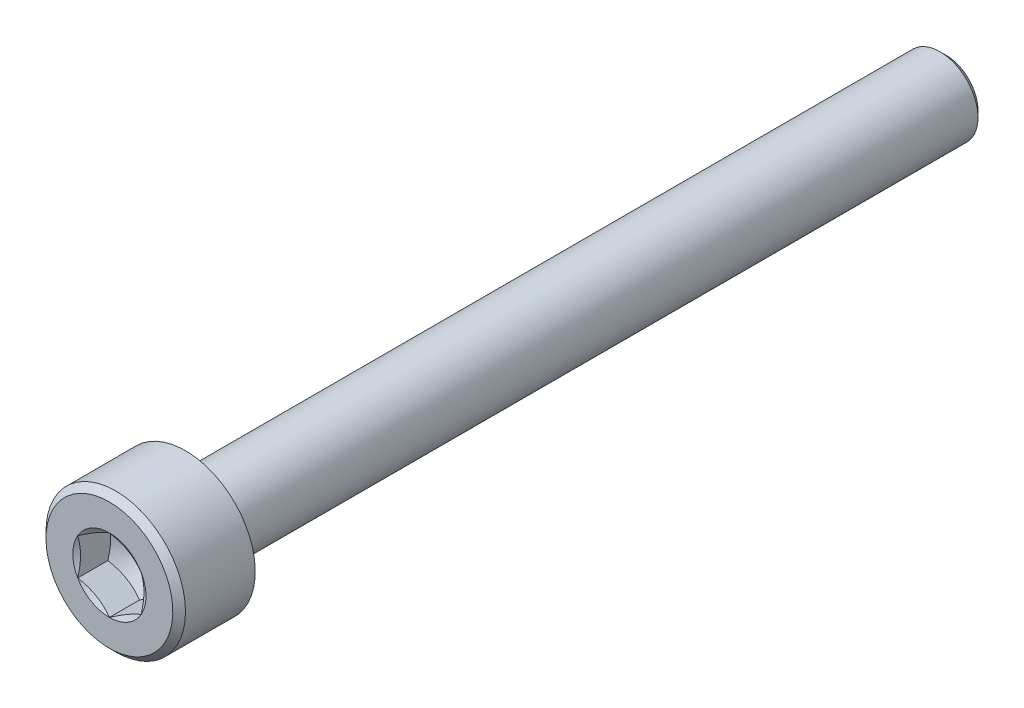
ISO-10303-21;
HEADER;
FILE_DESCRIPTION(('STEP AP214'),'2;1');
FILE_NAME('part.step','',(''),(''),'','','');
FILE_SCHEMA(('AUTOMOTIVE_DESIGN { 1 0 10303 214 1 1 1 1 }'));
ENDSEC;
DATA;
#1=APPLICATION_CONTEXT('core data for automotive mechanical design processes');
#2=APPLICATION_PROTOCOL_DEFINITION('international standard','automotive_design',2000,#1);
#3=PRODUCT_CONTEXT('',#1,'mechanical');
#4=PRODUCT('Part','Part','',(#3));
#5=PRODUCT_RELATED_PRODUCT_CATEGORY('part','',(#4));
#6=PRODUCT_DEFINITION_FORMATION('','',#4);
#7=PRODUCT_DEFINITION_CONTEXT('part definition',#1,'design');
#8=PRODUCT_DEFINITION('design','',#6,#7);
#9=PRODUCT_DEFINITION_SHAPE('','',#8);
#10=(LENGTH_UNIT() NAMED_UNIT(*) SI_UNIT(.MILLI.,.METRE.));
#11=(NAMED_UNIT(*) PLANE_ANGLE_UNIT() SI_UNIT($,.RADIAN.));
#12=(NAMED_UNIT(*) SI_UNIT($,.STERADIAN.) SOLID_ANGLE_UNIT());
#13=UNCERTAINTY_MEASURE_WITH_UNIT(LENGTH_MEASURE(1.E-05),#10,'distance_accuracy_value','');
#14=(GEOMETRIC_REPRESENTATION_CONTEXT(3) GLOBAL_UNCERTAINTY_ASSIGNED_CONTEXT((#13)) GLOBAL_UNIT_ASSIGNED_CONTEXT((#10,
#11,#12)) REPRESENTATION_CONTEXT('',''));
#15=CARTESIAN_POINT('',(0.,0.,0.));
#16=DIRECTION('',(0.,0.,1.));
#17=DIRECTION('',(1.,0.,0.));
#18=AXIS2_PLACEMENT_3D('',#15,#16,#17);
#19=CARTESIAN_POINT('',(0.,2.75,3.));
#20=DIRECTION('',(0.,0.,-1.));
#21=DIRECTION('',(0.,1.,0.));
#22=AXIS2_PLACEMENT_3D('',#19,#20,#21);
#23=PLANE('',#22);
#24=CARTESIAN_POINT('',(0.,0.,3.));
#25=DIRECTION('',(0.,0.,-1.));
#26=DIRECTION('',(0.,1.,0.));
#27=AXIS2_PLACEMENT_3D('',#24,#25,#26);
#28=CIRCLE('',#27,2.5);
#29=CARTESIAN_POINT('',(0.,2.5,3.));
#30=VERTEX_POINT('',#29);
#31=EDGE_CURVE('E298',#30,#30,#28,.F.);
#32=ORIENTED_EDGE('',*,*,#31,.T.);
#33=EDGE_LOOP('',(#32));
#34=FACE_BOUND('',#33,.T.);
#35=CARTESIAN_POINT('',(0.,0.,3.));
#36=DIRECTION('',(0.,0.,-1.));
#37=DIRECTION('',(0.,1.,0.));
#38=AXIS2_PLACEMENT_3D('',#35,#36,#37);
#39=CIRCLE('',#38,1.44337567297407);
#40=CARTESIAN_POINT('',(0.,1.44337567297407,3.));
#41=VERTEX_POINT('',#40);
#42=CARTESIAN_POINT('',(-1.25,0.721687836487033,3.));
#43=VERTEX_POINT('',#42);
#44=EDGE_CURVE('E109',#41,#43,#39,.F.);
#45=ORIENTED_EDGE('',*,*,#44,.F.);
#46=CARTESIAN_POINT('',(1.25,0.721687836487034,3.));
#47=VERTEX_POINT('',#46);
#48=EDGE_CURVE('E97',#47,#41,#39,.F.);
#49=ORIENTED_EDGE('',*,*,#48,.F.);
#50=CARTESIAN_POINT('',(1.25,-0.721687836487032,3.));
#51=VERTEX_POINT('',#50);
#52=EDGE_CURVE('E107',#51,#47,#39,.F.);
#53=ORIENTED_EDGE('',*,*,#52,.F.);
#54=CARTESIAN_POINT('',(0.,-1.44337567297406,3.));
#55=VERTEX_POINT('',#54);
#56=EDGE_CURVE('E474',#55,#51,#39,.F.);
#57=ORIENTED_EDGE('',*,*,#56,.F.);
#58=CARTESIAN_POINT('',(-1.25,-0.721687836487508,2.99999999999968));
#59=VERTEX_POINT('',#58);
#60=EDGE_CURVE('E142',#59,#55,#39,.F.);
#61=ORIENTED_EDGE('',*,*,#60,.F.);
#62=EDGE_CURVE('E139',#43,#59,#39,.F.);
#63=ORIENTED_EDGE('',*,*,#62,.F.);
#64=EDGE_LOOP('',(#45,#49,#53,#57,#61,#63));
#65=FACE_BOUND('',#64,.T.);
#66=ADVANCED_FACE('F40',(#34,#65),#23,.F.);
#67=CARTESIAN_POINT('',(0.,1.5,0.));
#68=DIRECTION('',(0.,0.,1.));
#69=DIRECTION('',(0.,-1.,0.));
#70=AXIS2_PLACEMENT_3D('',#67,#68,#69);
#71=PLANE('',#70);
#72=CARTESIAN_POINT('',(0.,0.,0.));
#73=DIRECTION('',(0.,0.,1.));
#74=DIRECTION('',(0.,-1.,0.));
#75=AXIS2_PLACEMENT_3D('',#72,#73,#74);
#76=CIRCLE('',#75,1.9);
#77=CARTESIAN_POINT('',(0.,-1.9,0.));
#78=VERTEX_POINT('',#77);
#79=EDGE_CURVE('E49',#78,#78,#76,.T.);
#80=ORIENTED_EDGE('',*,*,#79,.T.);
#81=EDGE_LOOP('',(#80));
#82=FACE_BOUND('',#81,.T.);
#83=CARTESIAN_POINT('',(0.,0.,0.));
#84=DIRECTION('',(0.,0.,1.));
#85=DIRECTION('',(0.,-1.,0.));
#86=AXIS2_PLACEMENT_3D('',#83,#84,#85);
#87=CIRCLE('',#86,2.75);
#88=CARTESIAN_POINT('',(0.,-2.75,0.));
#89=VERTEX_POINT('',#88);
#90=EDGE_CURVE('E442',#89,#89,#87,.T.);
#91=ORIENTED_EDGE('',*,*,#90,.F.);
#92=EDGE_LOOP('',(#91));
#93=FACE_BOUND('',#92,.T.);
#94=ADVANCED_FACE('F257',(#82,#93),#71,.F.);
#95=CARTESIAN_POINT('',(0.,0.,3.));
#96=DIRECTION('',(0.,0.,1.));
#97=DIRECTION('',(0.,-1.,0.));
#98=AXIS2_PLACEMENT_3D('',#95,#96,#97);
#99=CYLINDRICAL_SURFACE('',#98,1.5);
#100=CARTESIAN_POINT('',(0.,0.,-0.4));
#101=DIRECTION('',(0.,0.,1.));
#102=DIRECTION('',(0.,-1.,0.));
#103=AXIS2_PLACEMENT_3D('',#100,#101,#102);
#104=CIRCLE('',#103,1.5);
#105=CARTESIAN_POINT('',(0.,-1.5,-0.4));
#106=VERTEX_POINT('',#105);
#107=EDGE_CURVE('E12',#106,#106,#104,.F.);
#108=ORIENTED_EDGE('',*,*,#107,.T.);
#109=EDGE_LOOP('',(#108));
#110=FACE_BOUND('',#109,.T.);
#111=CARTESIAN_POINT('',(0.,0.,-29.75));
#112=DIRECTION('',(0.,0.,1.));
#113=DIRECTION('',(0.,-1.,0.));
#114=AXIS2_PLACEMENT_3D('',#111,#112,#113);
#115=CIRCLE('',#114,1.5);
#116=CARTESIAN_POINT('',(0.,-1.5,-29.75));
#117=VERTEX_POINT('',#116);
#118=EDGE_CURVE('E289',#117,#117,#115,.T.);
#119=ORIENTED_EDGE('',*,*,#118,.T.);
#120=EDGE_LOOP('',(#119));
#121=FACE_BOUND('',#120,.T.);
#122=ADVANCED_FACE('F262',(#110,#121),#99,.T.);
#123=CARTESIAN_POINT('',(0.,0.,-30.));
#124=DIRECTION('',(0.,0.,1.));
#125=DIRECTION('',(0.,-1.,0.));
#126=AXIS2_PLACEMENT_3D('',#123,#124,#125);
#127=PLANE('',#126);
#128=CARTESIAN_POINT('',(0.,0.,-30.));
#129=DIRECTION('',(0.,0.,1.));
#130=DIRECTION('',(0.,-1.,0.));
#131=AXIS2_PLACEMENT_3D('',#128,#129,#130);
#132=CIRCLE('',#131,1.25);
#133=CARTESIAN_POINT('',(0.,-1.25,-30.));
#134=VERTEX_POINT('',#133);
#135=EDGE_CURVE('E120',#134,#134,#132,.F.);
#136=ORIENTED_EDGE('',*,*,#135,.T.);
#137=EDGE_LOOP('',(#136));
#138=FACE_BOUND('',#137,.T.);
#139=ADVANCED_FACE('F267',(#138),#127,.F.);
#140=CARTESIAN_POINT('',(0.,0.,3.));
#141=DIRECTION('',(0.,0.,1.));
#142=DIRECTION('',(0.,-1.,0.));
#143=AXIS2_PLACEMENT_3D('',#140,#141,#142);
#144=CYLINDRICAL_SURFACE('',#143,2.75);
#145=CARTESIAN_POINT('',(0.,0.,2.75));
#146=DIRECTION('',(0.,0.,-1.));
#147=DIRECTION('',(0.,1.,0.));
#148=AXIS2_PLACEMENT_3D('',#145,#146,#147);
#149=CIRCLE('',#148,2.75);
#150=CARTESIAN_POINT('',(0.,2.75,2.75));
#151=VERTEX_POINT('',#150);
#152=EDGE_CURVE('E292',#151,#151,#149,.T.);
#153=ORIENTED_EDGE('',*,*,#152,.T.);
#154=EDGE_LOOP('',(#153));
#155=FACE_BOUND('',#154,.T.);
#156=ORIENTED_EDGE('',*,*,#90,.T.);
#157=EDGE_LOOP('',(#156));
#158=FACE_BOUND('',#157,.T.);
#159=ADVANCED_FACE('F177',(#155,#158),#144,.T.);
#160=CARTESIAN_POINT('',(0.,0.,3.));
#161=DIRECTION('',(0.,0.,-1.));
#162=DIRECTION('',(0.,1.,0.));
#163=AXIS2_PLACEMENT_3D('',#160,#161,#162);
#164=CONICAL_SURFACE('',#163,2.5,0.785398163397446);
#165=ORIENTED_EDGE('',*,*,#152,.F.);
#166=EDGE_LOOP('',(#165));
#167=FACE_BOUND('',#166,.T.);
#168=ORIENTED_EDGE('',*,*,#31,.F.);
#169=EDGE_LOOP('',(#168));
#170=FACE_BOUND('',#169,.T.);
#171=ADVANCED_FACE('F274',(#167,#170),#164,.T.);
#172=CARTESIAN_POINT('',(0.,0.,-29.75));
#173=DIRECTION('',(0.,0.,1.));
#174=DIRECTION('',(0.,-1.,0.));
#175=AXIS2_PLACEMENT_3D('',#172,#173,#174);
#176=CONICAL_SURFACE('',#175,1.5,0.785398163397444);
#177=ORIENTED_EDGE('',*,*,#135,.F.);
#178=EDGE_LOOP('',(#177));
#179=FACE_BOUND('',#178,.T.);
#180=ORIENTED_EDGE('',*,*,#118,.F.);
#181=EDGE_LOOP('',(#180));
#182=FACE_BOUND('',#181,.T.);
#183=ADVANCED_FACE('F276',(#179,#182),#176,.T.);
#184=CARTESIAN_POINT('',(0.,0.,2.8883545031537));
#185=DIRECTION('',(0.,0.,1.));
#186=DIRECTION('',(0.,-1.,0.));
#187=AXIS2_PLACEMENT_3D('',#184,#185,#186);
#188=CONICAL_SURFACE('',#187,1.25,1.04719755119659);
#189=ORIENTED_EDGE('',*,*,#44,.T.);
#190=CARTESIAN_POINT('',(-1.2502,0.721572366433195,3.00006667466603));
#191=CARTESIAN_POINT('',(-1.19526669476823,0.753288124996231,2.98174591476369));
#192=CARTESIAN_POINT('',(-1.13985921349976,0.785277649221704,2.96508330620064));
#193=CARTESIAN_POINT('',(-1.02808463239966,0.849810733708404,2.93599730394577));
#194=CARTESIAN_POINT('',(-0.971715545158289,0.882355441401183,2.92358420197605));
#195=CARTESIAN_POINT('',(-0.859676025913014,0.947041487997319,2.90425968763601));
#196=CARTESIAN_POINT('',(-0.804022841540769,0.979172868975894,2.89721968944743));
#197=CARTESIAN_POINT('',(-0.692454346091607,1.04358696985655,2.88881243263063));
#198=CARTESIAN_POINT('',(-0.636539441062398,1.07586945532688,2.88743821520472));
#199=CARTESIAN_POINT('',(-0.532042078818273,1.13620103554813,2.89028333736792));
#200=CARTESIAN_POINT('',(-0.483444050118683,1.16425912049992,2.89380409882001));
#201=CARTESIAN_POINT('',(-0.38656463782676,1.22019247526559,2.90496711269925));
#202=CARTESIAN_POINT('',(-0.338283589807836,1.24806755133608,2.91261318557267));
#203=CARTESIAN_POINT('',(-0.241204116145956,1.30411641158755,2.93172945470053));
#204=CARTESIAN_POINT('',(-0.1924179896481,1.33228309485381,2.94328075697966));
#205=CARTESIAN_POINT('',(-0.0955737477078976,1.38819614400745,2.96949831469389));
#206=CARTESIAN_POINT('',(-0.0475143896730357,1.41594322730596,2.9841584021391));
#207=CARTESIAN_POINT('',(0.000199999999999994,1.4434911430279,3.00006667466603));
#208=B_SPLINE_CURVE_WITH_KNOTS('',3,(#190,#191,#192,#193,#194,#195,#196,#197,#198,#199,#200,
#201,#202,#203,#204,#205,#206,#207),.UNSPECIFIED.,.F.,.F.,(4,2,2,2,2,2,2,2,4),(0.,
0.19815082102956,0.396778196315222,0.590488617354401,0.783961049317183,0.952480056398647,
1.1211553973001,1.2935743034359,1.4656542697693),.UNSPECIFIED.);
#209=EDGE_CURVE('E113',#43,#41,#208,.T.);
#210=ORIENTED_EDGE('',*,*,#209,.T.);
#211=EDGE_LOOP('',(#189,#210));
#212=FACE_BOUND('',#211,.T.);
#213=ADVANCED_FACE('F114',(#212),#188,.F.);
#214=ORIENTED_EDGE('',*,*,#62,.T.);
#215=CARTESIAN_POINT('',(-1.25,-1.91402249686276,3.48651288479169));
#216=CARTESIAN_POINT('',(-1.25,-1.85914046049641,3.45999038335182));
#217=CARTESIAN_POINT('',(-1.25,-1.80412861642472,3.43373221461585));
#218=CARTESIAN_POINT('',(-1.25,-1.69377524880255,3.38189383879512));
#219=CARTESIAN_POINT('',(-1.25,-1.6384336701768,3.35631374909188));
#220=CARTESIAN_POINT('',(-1.25,-1.52705181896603,3.30584606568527));
#221=CARTESIAN_POINT('',(-1.25,-1.47100936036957,3.28096327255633));
#222=CARTESIAN_POINT('',(-1.25,-1.35846343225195,3.23227191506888));
#223=CARTESIAN_POINT('',(-1.25,-1.30195998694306,3.20846329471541));
#224=CARTESIAN_POINT('',(-1.25,-1.13023285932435,3.13847265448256));
#225=CARTESIAN_POINT('',(-1.25,-1.0141519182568,3.09435658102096));
#226=CARTESIAN_POINT('',(-1.25,-0.779052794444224,3.01526341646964));
#227=CARTESIAN_POINT('',(-1.25,-0.660042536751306,2.98026411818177));
#228=CARTESIAN_POINT('',(-1.25,-0.478932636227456,2.93885499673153));
#229=CARTESIAN_POINT('',(-1.25,-0.418117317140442,2.92689892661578));
#230=CARTESIAN_POINT('',(-1.25,-0.295751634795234,2.90750168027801));
#231=CARTESIAN_POINT('',(-1.25,-0.234201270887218,2.90006050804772));
#232=CARTESIAN_POINT('',(-1.25,-0.11107808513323,2.8903495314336));
#233=CARTESIAN_POINT('',(-1.25,-0.0495079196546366,2.88804698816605));
#234=CARTESIAN_POINT('',(-1.25,0.0735831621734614,2.88872894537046));
#235=CARTESIAN_POINT('',(-1.25,0.135104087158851,2.8917120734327));
#236=CARTESIAN_POINT('',(-1.25,0.283935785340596,2.90505722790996));
#237=CARTESIAN_POINT('',(-1.25,0.371012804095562,2.91803134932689));
#238=CARTESIAN_POINT('',(-1.25,0.543555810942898,2.95222917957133));
#239=CARTESIAN_POINT('',(-1.25,0.629019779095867,2.97346259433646));
#240=CARTESIAN_POINT('',(-1.25,0.756929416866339,3.01007884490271));
#241=CARTESIAN_POINT('',(-1.25,0.800029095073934,3.02326523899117));
#242=CARTESIAN_POINT('',(-1.25,0.885776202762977,3.05094330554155));
#243=CARTESIAN_POINT('',(-1.25,0.928423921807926,3.06543407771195));
#244=CARTESIAN_POINT('',(-1.25,1.01309180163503,3.09541882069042));
#245=CARTESIAN_POINT('',(-1.25,1.05511414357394,3.1109066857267));
#246=CARTESIAN_POINT('',(-1.25,1.13883279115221,3.14279147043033));
#247=CARTESIAN_POINT('',(-1.25,1.18052895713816,3.15918875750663));
#248=CARTESIAN_POINT('',(-1.25,1.22207405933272,3.17595106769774));
#249=B_SPLINE_CURVE_WITH_KNOTS('',3,(#215,#216,#217,#218,#219,#220,#221,#222,#223,#224,#225,
#226,#227,#228,#229,#230,#231,#232,#233,#234,#235,#236,#237,#238,#239,#240,#241,#242,#243,#244,
#245,#246,#247,#248),.UNSPECIFIED.,.F.,.F.,(4,2,2,2,2,2,2,2,2,2,2,2,2,2,2,2,4),(0.,
0.182866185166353,0.365763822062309,0.549708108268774,0.733642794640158,1.10600436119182,
1.47745024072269,1.66325057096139,1.84905106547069,2.03366437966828,2.21822976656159,
2.48180397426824,2.74568886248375,2.88088820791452,3.01599494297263,3.15034120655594,
3.28474214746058),.UNSPECIFIED.);
#250=EDGE_CURVE('E239',#59,#43,#249,.T.);
#251=ORIENTED_EDGE('',*,*,#250,.T.);
#252=EDGE_LOOP('',(#214,#251));
#253=FACE_BOUND('',#252,.T.);
#254=ADVANCED_FACE('F283',(#253),#188,.F.);
#255=ORIENTED_EDGE('',*,*,#60,.T.);
#256=CARTESIAN_POINT('',(0.000200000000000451,-1.4434911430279,3.00006667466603));
#257=CARTESIAN_POINT('',(-0.0547333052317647,-1.41177538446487,2.98174591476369));
#258=CARTESIAN_POINT('',(-0.110140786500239,-1.37978586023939,2.96508330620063));
#259=CARTESIAN_POINT('',(-0.22191536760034,-1.31525277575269,2.93599730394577));
#260=CARTESIAN_POINT('',(-0.27828445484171,-1.28270806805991,2.92358420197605));
#261=CARTESIAN_POINT('',(-0.390323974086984,-1.21802202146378,2.90425968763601));
#262=CARTESIAN_POINT('',(-0.445977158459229,-1.1858906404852,2.89721968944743));
#263=CARTESIAN_POINT('',(-0.557545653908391,-1.12147653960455,2.88881243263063));
#264=CARTESIAN_POINT('',(-0.6134605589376,-1.08919405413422,2.88743821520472));
#265=CARTESIAN_POINT('',(-0.717957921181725,-1.02886247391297,2.89028333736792));
#266=CARTESIAN_POINT('',(-0.766555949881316,-1.00080438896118,2.89380409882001));
#267=CARTESIAN_POINT('',(-0.863435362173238,-0.944871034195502,2.90496711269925));
#268=CARTESIAN_POINT('',(-0.911716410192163,-0.916995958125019,2.91261318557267));
#269=CARTESIAN_POINT('',(-1.00879588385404,-0.860947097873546,2.93172945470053));
#270=CARTESIAN_POINT('',(-1.0575820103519,-0.832780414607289,2.94328075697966));
#271=CARTESIAN_POINT('',(-1.1544262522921,-0.776867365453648,2.96949831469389));
#272=CARTESIAN_POINT('',(-1.20248561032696,-0.74912028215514,2.9841584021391));
#273=CARTESIAN_POINT('',(-1.2502,-0.721572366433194,3.00006667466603));
#274=B_SPLINE_CURVE_WITH_KNOTS('',3,(#256,#257,#258,#259,#260,#261,#262,#263,#264,#265,#266,
#267,#268,#269,#270,#271,#272,#273),.UNSPECIFIED.,.F.,.F.,(4,2,2,2,2,2,2,2,4),(0.,
0.19815082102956,0.396778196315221,0.5904886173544,0.783961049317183,0.952480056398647,
1.1211553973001,1.2935743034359,1.4656542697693),.UNSPECIFIED.);
#275=EDGE_CURVE('E232',#55,#59,#274,.T.);
#276=ORIENTED_EDGE('',*,*,#275,.T.);
#277=EDGE_LOOP('',(#255,#276));
#278=FACE_BOUND('',#277,.T.);
#279=ADVANCED_FACE('F385',(#278),#188,.F.);
#280=ORIENTED_EDGE('',*,*,#56,.T.);
#281=CARTESIAN_POINT('',(1.2502,-0.721572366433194,3.00006667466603));
#282=CARTESIAN_POINT('',(1.19526669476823,-0.75328812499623,2.98174591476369));
#283=CARTESIAN_POINT('',(1.13985921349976,-0.785277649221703,2.96508330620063));
#284=CARTESIAN_POINT('',(1.02808463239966,-0.849810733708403,2.93599730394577));
#285=CARTESIAN_POINT('',(0.971715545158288,-0.882355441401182,2.92358420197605));
#286=CARTESIAN_POINT('',(0.859676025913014,-0.947041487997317,2.90425968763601));
#287=CARTESIAN_POINT('',(0.804022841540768,-0.979172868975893,2.89721968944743));
#288=CARTESIAN_POINT('',(0.692454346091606,-1.04358696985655,2.88881243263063));
#289=CARTESIAN_POINT('',(0.636539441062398,-1.07586945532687,2.88743821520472));
#290=CARTESIAN_POINT('',(0.532042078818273,-1.13620103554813,2.89028333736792));
#291=CARTESIAN_POINT('',(0.483444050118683,-1.16425912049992,2.89380409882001));
#292=CARTESIAN_POINT('',(0.38656463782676,-1.22019247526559,2.90496711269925));
#293=CARTESIAN_POINT('',(0.338283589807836,-1.24806755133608,2.91261318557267));
#294=CARTESIAN_POINT('',(0.241204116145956,-1.30411641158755,2.93172945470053));
#295=CARTESIAN_POINT('',(0.1924179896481,-1.33228309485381,2.94328075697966));
#296=CARTESIAN_POINT('',(0.095573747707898,-1.38819614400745,2.96949831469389));
#297=CARTESIAN_POINT('',(0.0475143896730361,-1.41594322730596,2.9841584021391));
#298=CARTESIAN_POINT('',(-0.000199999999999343,-1.4434911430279,3.00006667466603));
#299=B_SPLINE_CURVE_WITH_KNOTS('',3,(#281,#282,#283,#284,#285,#286,#287,#288,#289,#290,#291,
#292,#293,#294,#295,#296,#297,#298),.UNSPECIFIED.,.F.,.F.,(4,2,2,2,2,2,2,2,4),(0.,
0.19815082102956,0.396778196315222,0.590488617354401,0.783961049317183,0.952480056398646,
1.1211553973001,1.2935743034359,1.4656542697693),.UNSPECIFIED.);
#300=EDGE_CURVE('E61',#51,#55,#299,.T.);
#301=ORIENTED_EDGE('',*,*,#300,.T.);
#302=EDGE_LOOP('',(#280,#301));
#303=FACE_BOUND('',#302,.T.);
#304=ADVANCED_FACE('F378',(#303),#188,.F.);
#305=ORIENTED_EDGE('',*,*,#52,.T.);
#306=CARTESIAN_POINT('',(1.25,-1.91402249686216,3.4865128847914));
#307=CARTESIAN_POINT('',(1.25,-1.85914046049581,3.45999038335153));
#308=CARTESIAN_POINT('',(1.25,-1.80412861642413,3.43373221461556));
#309=CARTESIAN_POINT('',(1.25,-1.69377524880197,3.38189383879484));
#310=CARTESIAN_POINT('',(1.25,-1.63843367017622,3.35631374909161));
#311=CARTESIAN_POINT('',(1.25,-1.52705181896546,3.30584606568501));
#312=CARTESIAN_POINT('',(1.25,-1.471009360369,3.28096327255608));
#313=CARTESIAN_POINT('',(1.25,-1.35846343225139,3.23227191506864));
#314=CARTESIAN_POINT('',(1.25,-1.3019599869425,3.20846329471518));
#315=CARTESIAN_POINT('',(1.25,-1.13023285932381,3.13847265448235));
#316=CARTESIAN_POINT('',(1.25,-1.01415191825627,3.09435658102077));
#317=CARTESIAN_POINT('',(1.25,-0.779052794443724,3.01526341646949));
#318=CARTESIAN_POINT('',(1.25,-0.660042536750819,2.98026411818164));
#319=CARTESIAN_POINT('',(1.25,-0.478932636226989,2.93885499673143));
#320=CARTESIAN_POINT('',(1.25,-0.418117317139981,2.92689892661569));
#321=CARTESIAN_POINT('',(1.25,-0.295751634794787,2.90750168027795));
#322=CARTESIAN_POINT('',(1.25,-0.234201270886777,2.90006050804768));
#323=CARTESIAN_POINT('',(1.25,-0.111078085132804,2.89034953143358));
#324=CARTESIAN_POINT('',(1.25,-0.0495079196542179,2.88804698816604));
#325=CARTESIAN_POINT('',(1.25,0.0735831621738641,2.88872894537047));
#326=CARTESIAN_POINT('',(1.25,0.135104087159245,2.89171207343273));
#327=CARTESIAN_POINT('',(1.25,0.283935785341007,2.90505722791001));
#328=CARTESIAN_POINT('',(1.25,0.371012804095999,2.91803134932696));
#329=CARTESIAN_POINT('',(1.25,0.543555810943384,2.95222917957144));
#330=CARTESIAN_POINT('',(1.25,0.629019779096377,2.9734625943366));
#331=CARTESIAN_POINT('',(1.25,0.756929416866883,3.01007884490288));
#332=CARTESIAN_POINT('',(1.25,0.800029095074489,3.02326523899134));
#333=CARTESIAN_POINT('',(1.25,0.885776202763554,3.05094330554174));
#334=CARTESIAN_POINT('',(1.25,0.928423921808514,3.06543407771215));
#335=CARTESIAN_POINT('',(1.25,1.01309180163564,3.09541882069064));
#336=CARTESIAN_POINT('',(1.25,1.05511414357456,3.11090668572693));
#337=CARTESIAN_POINT('',(1.25,1.13883279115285,3.14279147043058));
#338=CARTESIAN_POINT('',(1.25,1.18052895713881,3.15918875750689));
#339=CARTESIAN_POINT('',(1.25,1.22207405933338,3.17595106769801));
#340=B_SPLINE_CURVE_WITH_KNOTS('',3,(#306,#307,#308,#309,#310,#311,#312,#313,#314,#315,#316,
#317,#318,#319,#320,#321,#322,#323,#324,#325,#326,#327,#328,#329,#330,#331,#332,#333,#334,#335,
#336,#337,#338,#339),.UNSPECIFIED.,.F.,.F.,(4,2,2,2,2,2,2,2,2,2,2,2,2,2,2,2,4),(0.,
0.182866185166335,0.365763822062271,0.549708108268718,0.733642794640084,1.10600436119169,
1.47745024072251,1.66325057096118,1.84905106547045,2.03366437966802,2.2182297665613,
2.48180397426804,2.74568886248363,2.88088820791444,3.01599494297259,3.15034120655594,
3.28474214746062),.UNSPECIFIED.);
#341=EDGE_CURVE('E55',#47,#51,#340,.F.);
#342=ORIENTED_EDGE('',*,*,#341,.T.);
#343=EDGE_LOOP('',(#305,#342));
#344=FACE_BOUND('',#343,.T.);
#345=ADVANCED_FACE('F371',(#344),#188,.F.);
#346=ORIENTED_EDGE('',*,*,#48,.T.);
#347=CARTESIAN_POINT('',(-0.000200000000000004,1.4434911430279,3.00006667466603));
#348=CARTESIAN_POINT('',(0.0547333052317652,1.41177538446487,2.98174591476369));
#349=CARTESIAN_POINT('',(0.11014078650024,1.37978586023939,2.96508330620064));
#350=CARTESIAN_POINT('',(0.22191536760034,1.31525277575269,2.93599730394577));
#351=CARTESIAN_POINT('',(0.278284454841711,1.28270806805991,2.92358420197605));
#352=CARTESIAN_POINT('',(0.390323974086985,1.21802202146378,2.90425968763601));
#353=CARTESIAN_POINT('',(0.44597715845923,1.1858906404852,2.89721968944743));
#354=CARTESIAN_POINT('',(0.557545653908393,1.12147653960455,2.88881243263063));
#355=CARTESIAN_POINT('',(0.613460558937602,1.08919405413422,2.88743821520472));
#356=CARTESIAN_POINT('',(0.717957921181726,1.02886247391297,2.89028333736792));
#357=CARTESIAN_POINT('',(0.766555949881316,1.00080438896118,2.89380409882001));
#358=CARTESIAN_POINT('',(0.863435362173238,0.944871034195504,2.90496711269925));
#359=CARTESIAN_POINT('',(0.911716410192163,0.91699595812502,2.91261318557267));
#360=CARTESIAN_POINT('',(1.00879588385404,0.860947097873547,2.93172945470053));
#361=CARTESIAN_POINT('',(1.0575820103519,0.832780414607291,2.94328075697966));
#362=CARTESIAN_POINT('',(1.1544262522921,0.77686736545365,2.96949831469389));
#363=CARTESIAN_POINT('',(1.20248561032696,0.749120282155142,2.9841584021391));
#364=CARTESIAN_POINT('',(1.2502,0.721572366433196,3.00006667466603));
#365=B_SPLINE_CURVE_WITH_KNOTS('',3,(#347,#348,#349,#350,#351,#352,#353,#354,#355,#356,#357,
#358,#359,#360,#361,#362,#363,#364),.UNSPECIFIED.,.F.,.F.,(4,2,2,2,2,2,2,2,4),(0.,
0.19815082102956,0.396778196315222,0.590488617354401,0.783961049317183,0.952480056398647,
1.1211553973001,1.2935743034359,1.4656542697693),.UNSPECIFIED.);
#366=EDGE_CURVE('E101',#41,#47,#365,.T.);
#367=ORIENTED_EDGE('',*,*,#366,.T.);
#368=EDGE_LOOP('',(#346,#367));
#369=FACE_BOUND('',#368,.T.);
#370=ADVANCED_FACE('F99',(#369),#188,.F.);
#371=CARTESIAN_POINT('',(0.,0.,0.978312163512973));
#372=DIRECTION('',(0.,0.,1.));
#373=DIRECTION('',(1.,0.,0.));
#374=AXIS2_PLACEMENT_3D('',#371,#372,#373);
#375=CONICAL_SURFACE('',#374,0.,1.0471975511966);
#376=CARTESIAN_POINT('',(1.2502,-0.721572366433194,1.81171217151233));
#377=CARTESIAN_POINT('',(1.19526669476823,-0.753288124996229,1.79339141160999));
#378=CARTESIAN_POINT('',(1.13985921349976,-0.785277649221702,1.77672880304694));
#379=CARTESIAN_POINT('',(1.02808463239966,-0.849810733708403,1.74764280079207));
#380=CARTESIAN_POINT('',(0.971715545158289,-0.882355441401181,1.73522969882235));
#381=CARTESIAN_POINT('',(0.859676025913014,-0.947041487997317,1.71590518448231));
#382=CARTESIAN_POINT('',(0.80402284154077,-0.979172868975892,1.70886518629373));
#383=CARTESIAN_POINT('',(0.692454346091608,-1.04358696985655,1.70045792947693));
#384=CARTESIAN_POINT('',(0.636539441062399,-1.07586945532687,1.69908371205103));
#385=CARTESIAN_POINT('',(0.532042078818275,-1.13620103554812,1.70192883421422));
#386=CARTESIAN_POINT('',(0.483444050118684,-1.16425912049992,1.70544959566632));
#387=CARTESIAN_POINT('',(0.386564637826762,-1.22019247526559,1.71661260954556));
#388=CARTESIAN_POINT('',(0.338283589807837,-1.24806755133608,1.72425868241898));
#389=CARTESIAN_POINT('',(0.241204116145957,-1.30411641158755,1.74337495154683));
#390=CARTESIAN_POINT('',(0.192417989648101,-1.33228309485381,1.75492625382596));
#391=CARTESIAN_POINT('',(0.0955737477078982,-1.38819614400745,1.78114381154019));
#392=CARTESIAN_POINT('',(0.0475143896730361,-1.41594322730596,1.79580389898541));
#393=CARTESIAN_POINT('',(-0.000199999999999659,-1.4434911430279,1.81171217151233));
#394=B_SPLINE_CURVE_WITH_KNOTS('',3,(#376,#377,#378,#379,#380,#381,#382,#383,#384,#385,#386,
#387,#388,#389,#390,#391,#392,#393),.UNSPECIFIED.,.F.,.F.,(4,2,2,2,2,2,2,2,4),(0.,
0.198150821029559,0.39677819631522,0.590488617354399,0.783961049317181,0.952480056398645,
1.1211553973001,1.2935743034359,1.4656542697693),.UNSPECIFIED.);
#395=CARTESIAN_POINT('',(1.25,-0.721687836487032,1.8116454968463));
#396=VERTEX_POINT('',#395);
#397=CARTESIAN_POINT('',(0.,-1.44337567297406,1.8116454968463));
#398=VERTEX_POINT('',#397);
#399=EDGE_CURVE('E191',#396,#398,#394,.T.);
#400=ORIENTED_EDGE('',*,*,#399,.F.);
#401=CARTESIAN_POINT('',(1.25,-1.90865231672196,2.29556355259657));
#402=CARTESIAN_POINT('',(1.25,-1.85425272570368,2.26929615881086));
#403=CARTESIAN_POINT('',(1.25,-1.79972483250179,2.24329032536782));
#404=CARTESIAN_POINT('',(1.25,-1.69034412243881,2.19194794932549));
#405=CARTESIAN_POINT('',(1.25,-1.6354912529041,2.16661151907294));
#406=CARTESIAN_POINT('',(1.25,-1.52509552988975,2.11662040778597));
#407=CARTESIAN_POINT('',(1.25,-1.46955052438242,2.09197045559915));
#408=CARTESIAN_POINT('',(1.25,-1.35800709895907,2.04372723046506));
#409=CARTESIAN_POINT('',(1.25,-1.30200870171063,2.02013390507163));
#410=CARTESIAN_POINT('',(1.25,-1.13003304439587,1.95002578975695));
#411=CARTESIAN_POINT('',(1.25,-1.01317915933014,1.90562272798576));
#412=CARTESIAN_POINT('',(1.25,-0.776487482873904,1.82609844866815));
#413=CARTESIAN_POINT('',(1.25,-0.656657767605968,1.79095459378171));
#414=CARTESIAN_POINT('',(1.25,-0.474573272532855,1.74959822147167));
#415=CARTESIAN_POINT('',(1.25,-0.413622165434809,1.73771944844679));
#416=CARTESIAN_POINT('',(1.25,-0.290993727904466,1.71851411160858));
#417=CARTESIAN_POINT('',(1.25,-0.229316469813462,1.71118709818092));
#418=CARTESIAN_POINT('',(1.25,-0.106331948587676,1.7017635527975));
#419=CARTESIAN_POINT('',(1.25,-0.0450297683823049,1.69960248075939));
#420=CARTESIAN_POINT('',(1.25,0.0775357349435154,1.70051952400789));
#421=CARTESIAN_POINT('',(1.25,0.138799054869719,1.70359802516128));
#422=CARTESIAN_POINT('',(1.25,0.287465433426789,1.71715562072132));
#423=CARTESIAN_POINT('',(1.25,0.374628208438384,1.7302746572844));
#424=CARTESIAN_POINT('',(1.25,0.547331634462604,1.76474816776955));
#425=CARTESIAN_POINT('',(1.25,0.632870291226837,1.78611215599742));
#426=CARTESIAN_POINT('',(1.25,0.76090714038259,1.82291671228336));
#427=CARTESIAN_POINT('',(1.25,0.804059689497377,1.83616800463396));
#428=CARTESIAN_POINT('',(1.25,0.889915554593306,1.86397308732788));
#429=CARTESIAN_POINT('',(1.25,0.93261912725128,1.87852608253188));
#430=CARTESIAN_POINT('',(1.25,1.01763382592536,1.90871622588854));
#431=CARTESIAN_POINT('',(1.25,1.05994498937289,1.92435326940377));
#432=CARTESIAN_POINT('',(1.25,1.14422664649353,1.95653477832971));
#433=CARTESIAN_POINT('',(1.25,1.18619708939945,1.97307937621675));
#434=CARTESIAN_POINT('',(1.25,1.32746610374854,2.03023162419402));
#435=CARTESIAN_POINT('',(1.25,1.42606013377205,2.07257978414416));
#436=CARTESIAN_POINT('',(1.25,1.62201077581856,2.16005979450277));
#437=CARTESIAN_POINT('',(1.25,1.71936712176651,2.20519223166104));
#438=CARTESIAN_POINT('',(1.25,1.91321882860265,2.29738841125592));
#439=CARTESIAN_POINT('',(1.25,2.00971372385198,2.34445312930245));
#440=CARTESIAN_POINT('',(1.25,2.20203186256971,2.43993833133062));
#441=CARTESIAN_POINT('',(1.25,2.29785507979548,2.48835886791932));
#442=CARTESIAN_POINT('',(1.25,2.58499079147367,2.63528926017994));
#443=CARTESIAN_POINT('',(1.25,2.77555176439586,2.73526483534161));
#444=CARTESIAN_POINT('',(1.25,3.15542833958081,2.93738447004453));
#445=CARTESIAN_POINT('',(1.25,3.34474433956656,3.03952778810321));
#446=CARTESIAN_POINT('',(1.25,3.69516589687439,3.23026427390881));
#447=CARTESIAN_POINT('',(1.25,3.8563736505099,3.31866986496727));
#448=CARTESIAN_POINT('',(1.25,4.17841142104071,3.49620418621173));
#449=CARTESIAN_POINT('',(1.25,4.33924139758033,3.58533298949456));
#450=CARTESIAN_POINT('',(1.25,4.65998152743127,3.76375562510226));
#451=CARTESIAN_POINT('',(1.25,4.81989281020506,3.85304742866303));
#452=CARTESIAN_POINT('',(1.25,5.13947795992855,4.03201306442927));
#453=CARTESIAN_POINT('',(1.25,5.29915185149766,4.12168685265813));
#454=CARTESIAN_POINT('',(1.25,5.458748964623,4.21149636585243));
#455=B_SPLINE_CURVE_WITH_KNOTS('',3,(#401,#402,#403,#404,#405,#406,#407,#408,#409,#410,#411,
#412,#413,#414,#415,#416,#417,#418,#419,#420,#421,#422,#423,#424,#425,#426,#427,#428,#429,#430,
#431,#432,#433,#434,#435,#436,#437,#438,#439,#440,#441,#442,#443,#444,#445,#446,#447,#448,#449,
#450,#451,#452,#453,#454),.UNSPECIFIED.,.F.,.F.,(4,2,2,2,2,2,2,2,2,2,2,2,2,2,2,2,2,2,2,2,2,2,2,
2,2,2,4),(0.,0.181229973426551,0.362490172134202,0.544787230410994,0.727075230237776,
1.10190695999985,1.4758135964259,1.66196712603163,1.84810226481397,2.03189950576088,
2.21571028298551,2.47960388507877,2.74380292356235,2.87921099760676,3.01453691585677,
3.14984978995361,3.28518246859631,3.60701679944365,3.92891918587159,4.25098614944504,
4.57306562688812,5.21861727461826,5.86395155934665,6.41552058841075,6.96714607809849,
7.51660137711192,8.0659950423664),.UNSPECIFIED.);
#456=CARTESIAN_POINT('',(1.25,0.721687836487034,1.8116454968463));
#457=VERTEX_POINT('',#456);
#458=EDGE_CURVE('E198',#457,#396,#455,.F.);
#459=ORIENTED_EDGE('',*,*,#458,.F.);
#460=CARTESIAN_POINT('',(-0.000200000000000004,1.4434911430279,1.81171217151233));
#461=CARTESIAN_POINT('',(0.0547333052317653,1.41177538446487,1.79339141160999));
#462=CARTESIAN_POINT('',(0.11014078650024,1.37978586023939,1.77672880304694));
#463=CARTESIAN_POINT('',(0.22191536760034,1.31525277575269,1.74764280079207));
#464=CARTESIAN_POINT('',(0.27828445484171,1.28270806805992,1.73522969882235));
#465=CARTESIAN_POINT('',(0.390323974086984,1.21802202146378,1.71590518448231));
#466=CARTESIAN_POINT('',(0.445977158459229,1.1858906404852,1.70886518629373));
#467=CARTESIAN_POINT('',(0.557545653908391,1.12147653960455,1.70045792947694));
#468=CARTESIAN_POINT('',(0.6134605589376,1.08919405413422,1.69908371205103));
#469=CARTESIAN_POINT('',(0.717957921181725,1.02886247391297,1.70192883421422));
#470=CARTESIAN_POINT('',(0.766555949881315,1.00080438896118,1.70544959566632));
#471=CARTESIAN_POINT('',(0.863435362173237,0.944871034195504,1.71661260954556));
#472=CARTESIAN_POINT('',(0.911716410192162,0.916995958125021,1.72425868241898));
#473=CARTESIAN_POINT('',(1.00879588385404,0.860947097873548,1.74337495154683));
#474=CARTESIAN_POINT('',(1.0575820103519,0.832780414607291,1.75492625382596));
#475=CARTESIAN_POINT('',(1.1544262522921,0.77686736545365,1.78114381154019));
#476=CARTESIAN_POINT('',(1.20248561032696,0.749120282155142,1.79580389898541));
#477=CARTESIAN_POINT('',(1.2502,0.721572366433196,1.81171217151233));
#478=B_SPLINE_CURVE_WITH_KNOTS('',3,(#460,#461,#462,#463,#464,#465,#466,#467,#468,#469,#470,
#471,#472,#473,#474,#475,#476,#477),.UNSPECIFIED.,.F.,.F.,(4,2,2,2,2,2,2,2,4),(0.,
0.198150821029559,0.396778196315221,0.5904886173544,0.783961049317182,0.952480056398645,
1.1211553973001,1.2935743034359,1.4656542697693),.UNSPECIFIED.);
#479=CARTESIAN_POINT('',(0.,1.44337567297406,1.8116454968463));
#480=VERTEX_POINT('',#479);
#481=EDGE_CURVE('E206',#480,#457,#478,.T.);
#482=ORIENTED_EDGE('',*,*,#481,.F.);
#483=CARTESIAN_POINT('',(-1.2502,0.721572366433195,1.81171217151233));
#484=CARTESIAN_POINT('',(-1.19526669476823,0.753288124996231,1.79339141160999));
#485=CARTESIAN_POINT('',(-1.13985921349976,0.785277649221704,1.77672880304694));
#486=CARTESIAN_POINT('',(-1.02808463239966,0.849810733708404,1.74764280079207));
#487=CARTESIAN_POINT('',(-0.971715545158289,0.882355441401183,1.73522969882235));
#488=CARTESIAN_POINT('',(-0.859676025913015,0.947041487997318,1.71590518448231));
#489=CARTESIAN_POINT('',(-0.80402284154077,0.979172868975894,1.70886518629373));
#490=CARTESIAN_POINT('',(-0.692454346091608,1.04358696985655,1.70045792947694));
#491=CARTESIAN_POINT('',(-0.636539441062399,1.07586945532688,1.69908371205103));
#492=CARTESIAN_POINT('',(-0.532042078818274,1.13620103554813,1.70192883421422));
#493=CARTESIAN_POINT('',(-0.483444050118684,1.16425912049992,1.70544959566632));
#494=CARTESIAN_POINT('',(-0.386564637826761,1.22019247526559,1.71661260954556));
#495=CARTESIAN_POINT('',(-0.338283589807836,1.24806755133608,1.72425868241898));
#496=CARTESIAN_POINT('',(-0.241204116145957,1.30411641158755,1.74337495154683));
#497=CARTESIAN_POINT('',(-0.1924179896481,1.33228309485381,1.75492625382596));
#498=CARTESIAN_POINT('',(-0.0955737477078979,1.38819614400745,1.78114381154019));
#499=CARTESIAN_POINT('',(-0.0475143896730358,1.41594322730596,1.79580389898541));
#500=CARTESIAN_POINT('',(0.000199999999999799,1.4434911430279,1.81171217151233));
#501=B_SPLINE_CURVE_WITH_KNOTS('',3,(#483,#484,#485,#486,#487,#488,#489,#490,#491,#492,#493,
#494,#495,#496,#497,#498,#499,#500),.UNSPECIFIED.,.F.,.F.,(4,2,2,2,2,2,2,2,4),(0.,
0.19815082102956,0.396778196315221,0.5904886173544,0.783961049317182,0.952480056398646,
1.1211553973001,1.2935743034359,1.4656542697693),.UNSPECIFIED.);
#502=CARTESIAN_POINT('',(-1.25,0.721687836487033,1.8116454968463));
#503=VERTEX_POINT('',#502);
#504=EDGE_CURVE('E132',#503,#480,#501,.T.);
#505=ORIENTED_EDGE('',*,*,#504,.F.);
#506=CARTESIAN_POINT('',(-1.25,-1.90865231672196,2.29556355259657));
#507=CARTESIAN_POINT('',(-1.25,-1.85425272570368,2.26929615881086));
#508=CARTESIAN_POINT('',(-1.25,-1.79972483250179,2.24329032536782));
#509=CARTESIAN_POINT('',(-1.25,-1.69034412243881,2.19194794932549));
#510=CARTESIAN_POINT('',(-1.25,-1.6354912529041,2.16661151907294));
#511=CARTESIAN_POINT('',(-1.25,-1.52509552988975,2.11662040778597));
#512=CARTESIAN_POINT('',(-1.25,-1.46955052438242,2.09197045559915));
#513=CARTESIAN_POINT('',(-1.25,-1.35800709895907,2.04372723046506));
#514=CARTESIAN_POINT('',(-1.25,-1.30200870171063,2.02013390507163));
#515=CARTESIAN_POINT('',(-1.25,-1.13003304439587,1.95002578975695));
#516=CARTESIAN_POINT('',(-1.25,-1.01317915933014,1.90562272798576));
#517=CARTESIAN_POINT('',(-1.25,-0.776487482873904,1.82609844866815));
#518=CARTESIAN_POINT('',(-1.25,-0.656657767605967,1.79095459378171));
#519=CARTESIAN_POINT('',(-1.25,-0.474573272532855,1.74959822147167));
#520=CARTESIAN_POINT('',(-1.25,-0.413622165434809,1.73771944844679));
#521=CARTESIAN_POINT('',(-1.25,-0.290993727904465,1.71851411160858));
#522=CARTESIAN_POINT('',(-1.25,-0.229316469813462,1.71118709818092));
#523=CARTESIAN_POINT('',(-1.25,-0.106331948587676,1.7017635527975));
#524=CARTESIAN_POINT('',(-1.25,-0.0450297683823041,1.69960248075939));
#525=CARTESIAN_POINT('',(-1.25,0.0775357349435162,1.70051952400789));
#526=CARTESIAN_POINT('',(-1.25,0.138799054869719,1.70359802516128));
#527=CARTESIAN_POINT('',(-1.25,0.287465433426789,1.71715562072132));
#528=CARTESIAN_POINT('',(-1.25,0.374628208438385,1.7302746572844));
#529=CARTESIAN_POINT('',(-1.25,0.547331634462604,1.76474816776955));
#530=CARTESIAN_POINT('',(-1.25,0.632870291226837,1.78611215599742));
#531=CARTESIAN_POINT('',(-1.25,0.760907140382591,1.82291671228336));
#532=CARTESIAN_POINT('',(-1.25,0.804059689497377,1.83616800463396));
#533=CARTESIAN_POINT('',(-1.25,0.889915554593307,1.86397308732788));
#534=CARTESIAN_POINT('',(-1.25,0.932619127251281,1.87852608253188));
#535=CARTESIAN_POINT('',(-1.25,1.01763382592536,1.90871622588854));
#536=CARTESIAN_POINT('',(-1.25,1.05994498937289,1.92435326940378));
#537=CARTESIAN_POINT('',(-1.25,1.14422664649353,1.95653477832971));
#538=CARTESIAN_POINT('',(-1.25,1.18619708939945,1.97307937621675));
#539=CARTESIAN_POINT('',(-1.25,1.32746610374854,2.03023162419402));
#540=CARTESIAN_POINT('',(-1.25,1.42606013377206,2.07257978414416));
#541=CARTESIAN_POINT('',(-1.25,1.62201077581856,2.16005979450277));
#542=CARTESIAN_POINT('',(-1.25,1.71936712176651,2.20519223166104));
#543=CARTESIAN_POINT('',(-1.25,1.91321882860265,2.29738841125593));
#544=CARTESIAN_POINT('',(-1.25,2.00971372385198,2.34445312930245));
#545=CARTESIAN_POINT('',(-1.25,2.20203186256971,2.43993833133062));
#546=CARTESIAN_POINT('',(-1.25,2.29785507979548,2.48835886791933));
#547=CARTESIAN_POINT('',(-1.25,2.58499079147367,2.63528926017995));
#548=CARTESIAN_POINT('',(-1.25,2.77555176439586,2.73526483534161));
#549=CARTESIAN_POINT('',(-1.25,3.15542833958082,2.93738447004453));
#550=CARTESIAN_POINT('',(-1.25,3.34474433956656,3.03952778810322));
#551=CARTESIAN_POINT('',(-1.25,3.6951658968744,3.23026427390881));
#552=CARTESIAN_POINT('',(-1.25,3.8563736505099,3.31866986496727));
#553=CARTESIAN_POINT('',(-1.25,4.17841142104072,3.49620418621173));
#554=CARTESIAN_POINT('',(-1.25,4.33924139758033,3.58533298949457));
#555=CARTESIAN_POINT('',(-1.25,4.65998152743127,3.76375562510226));
#556=CARTESIAN_POINT('',(-1.25,4.81989281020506,3.85304742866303));
#557=CARTESIAN_POINT('',(-1.25,5.13947795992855,4.03201306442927));
#558=CARTESIAN_POINT('',(-1.25,5.29915185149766,4.12168685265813));
#559=CARTESIAN_POINT('',(-1.25,5.458748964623,4.21149636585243));
#560=B_SPLINE_CURVE_WITH_KNOTS('',3,(#506,#507,#508,#509,#510,#511,#512,#513,#514,#515,#516,
#517,#518,#519,#520,#521,#522,#523,#524,#525,#526,#527,#528,#529,#530,#531,#532,#533,#534,#535,
#536,#537,#538,#539,#540,#541,#542,#543,#544,#545,#546,#547,#548,#549,#550,#551,#552,#553,#554,
#555,#556,#557,#558,#559),.UNSPECIFIED.,.F.,.F.,(4,2,2,2,2,2,2,2,2,2,2,2,2,2,2,2,2,2,2,2,2,2,2,
2,2,2,4),(0.,0.181229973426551,0.362490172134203,0.544787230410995,0.727075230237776,
1.10190695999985,1.4758135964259,1.66196712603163,1.84810226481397,2.03189950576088,
2.21571028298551,2.47960388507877,2.74380292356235,2.87921099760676,3.01453691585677,
3.14984978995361,3.28518246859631,3.60701679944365,3.92891918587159,4.25098614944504,
4.57306562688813,5.21861727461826,5.86395155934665,6.41552058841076,6.96714607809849,
7.51660137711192,8.0659950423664),.UNSPECIFIED.);
#561=CARTESIAN_POINT('',(-1.25,-0.721687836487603,1.81164549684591));
#562=VERTEX_POINT('',#561);
#563=EDGE_CURVE('E151',#562,#503,#560,.T.);
#564=ORIENTED_EDGE('',*,*,#563,.F.);
#565=CARTESIAN_POINT('',(0.000200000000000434,-1.4434911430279,1.81171217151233));
#566=CARTESIAN_POINT('',(-0.0547333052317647,-1.41177538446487,1.79339141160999));
#567=CARTESIAN_POINT('',(-0.110140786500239,-1.37978586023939,1.77672880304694));
#568=CARTESIAN_POINT('',(-0.221915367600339,-1.31525277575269,1.74764280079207));
#569=CARTESIAN_POINT('',(-0.27828445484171,-1.28270806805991,1.73522969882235));
#570=CARTESIAN_POINT('',(-0.390323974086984,-1.21802202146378,1.71590518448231));
#571=CARTESIAN_POINT('',(-0.445977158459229,-1.1858906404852,1.70886518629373));
#572=CARTESIAN_POINT('',(-0.55754565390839,-1.12147653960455,1.70045792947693));
#573=CARTESIAN_POINT('',(-0.613460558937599,-1.08919405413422,1.69908371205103));
#574=CARTESIAN_POINT('',(-0.717957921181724,-1.02886247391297,1.70192883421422));
#575=CARTESIAN_POINT('',(-0.766555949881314,-1.00080438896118,1.70544959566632));
#576=CARTESIAN_POINT('',(-0.863435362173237,-0.944871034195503,1.71661260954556));
#577=CARTESIAN_POINT('',(-0.911716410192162,-0.916995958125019,1.72425868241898));
#578=CARTESIAN_POINT('',(-1.00879588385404,-0.860947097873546,1.74337495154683));
#579=CARTESIAN_POINT('',(-1.0575820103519,-0.832780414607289,1.75492625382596));
#580=CARTESIAN_POINT('',(-1.1544262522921,-0.776867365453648,1.78114381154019));
#581=CARTESIAN_POINT('',(-1.20248561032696,-0.74912028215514,1.79580389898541));
#582=CARTESIAN_POINT('',(-1.2502,-0.721572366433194,1.81171217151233));
#583=B_SPLINE_CURVE_WITH_KNOTS('',3,(#565,#566,#567,#568,#569,#570,#571,#572,#573,#574,#575,
#576,#577,#578,#579,#580,#581,#582),.UNSPECIFIED.,.F.,.F.,(4,2,2,2,2,2,2,2,4),(0.,
0.198150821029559,0.39677819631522,0.590488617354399,0.783961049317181,0.952480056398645,
1.1211553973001,1.2935743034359,1.4656542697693),.UNSPECIFIED.);
#584=EDGE_CURVE('E161',#398,#562,#583,.T.);
#585=ORIENTED_EDGE('',*,*,#584,.F.);
#586=EDGE_LOOP('',(#400,#459,#482,#505,#564,#585));
#587=FACE_BOUND('',#586,.T.);
#588=CARTESIAN_POINT('',(0.,0.,0.978312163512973));
#589=VERTEX_POINT('',#588);
#590=VERTEX_LOOP('',#589);
#591=FACE_BOUND('',#590,.T.);
#592=ADVANCED_FACE('F171',(#587,#591),#375,.F.);
#593=CARTESIAN_POINT('',(0.,1.44337567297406,-30.001));
#594=DIRECTION('',(-0.5,0.866025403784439,0.));
#595=DIRECTION('',(-0.866025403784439,-0.5,0.));
#596=AXIS2_PLACEMENT_3D('',#593,#594,#595);
#597=PLANE('',#596);
#598=ORIENTED_EDGE('',*,*,#209,.F.);
#599=DIRECTION('',(0.,0.,1.));
#600=VECTOR('',#599,1.);
#601=CARTESIAN_POINT('',(-1.25,0.721687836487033,-30.001));
#602=LINE('',#601,#600);
#603=EDGE_CURVE('E134',#503,#43,#602,.T.);
#604=ORIENTED_EDGE('',*,*,#603,.F.);
#605=ORIENTED_EDGE('',*,*,#504,.T.);
#606=DIRECTION('',(0.,0.,1.));
#607=VECTOR('',#606,1.);
#608=CARTESIAN_POINT('',(0.,1.44337567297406,-30.001));
#609=LINE('',#608,#607);
#610=EDGE_CURVE('E125',#480,#41,#609,.T.);
#611=ORIENTED_EDGE('',*,*,#610,.T.);
#612=EDGE_LOOP('',(#598,#604,#605,#611));
#613=FACE_BOUND('',#612,.T.);
#614=ADVANCED_FACE('F131',(#613),#597,.F.);
#615=CARTESIAN_POINT('',(-1.25,0.721687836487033,-30.001));
#616=DIRECTION('',(-1.,0.,0.));
#617=DIRECTION('',(0.,-1.,0.));
#618=AXIS2_PLACEMENT_3D('',#615,#616,#617);
#619=PLANE('',#618);
#620=ORIENTED_EDGE('',*,*,#250,.F.);
#621=DIRECTION('',(0.,0.,1.));
#622=VECTOR('',#621,1.);
#623=CARTESIAN_POINT('',(-1.25,-0.721687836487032,-30.001));
#624=LINE('',#623,#622);
#625=EDGE_CURVE('E462',#562,#59,#624,.T.);
#626=ORIENTED_EDGE('',*,*,#625,.F.);
#627=ORIENTED_EDGE('',*,*,#563,.T.);
#628=ORIENTED_EDGE('',*,*,#603,.T.);
#629=EDGE_LOOP('',(#620,#626,#627,#628));
#630=FACE_BOUND('',#629,.T.);
#631=ADVANCED_FACE('F168',(#630),#619,.F.);
#632=CARTESIAN_POINT('',(-1.25,-0.721687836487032,-30.001));
#633=DIRECTION('',(-0.5,-0.866025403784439,0.));
#634=DIRECTION('',(0.866025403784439,-0.5,0.));
#635=AXIS2_PLACEMENT_3D('',#632,#633,#634);
#636=PLANE('',#635);
#637=ORIENTED_EDGE('',*,*,#275,.F.);
#638=DIRECTION('',(0.,0.,1.));
#639=VECTOR('',#638,1.);
#640=CARTESIAN_POINT('',(0.,-1.44337567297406,-30.001));
#641=LINE('',#640,#639);
#642=EDGE_CURVE('E456',#398,#55,#641,.T.);
#643=ORIENTED_EDGE('',*,*,#642,.F.);
#644=ORIENTED_EDGE('',*,*,#584,.T.);
#645=ORIENTED_EDGE('',*,*,#625,.T.);
#646=EDGE_LOOP('',(#637,#643,#644,#645));
#647=FACE_BOUND('',#646,.T.);
#648=ADVANCED_FACE('F244',(#647),#636,.F.);
#649=CARTESIAN_POINT('',(0.,-1.44337567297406,-30.001));
#650=DIRECTION('',(0.5,-0.866025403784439,0.));
#651=DIRECTION('',(0.866025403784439,0.5,0.));
#652=AXIS2_PLACEMENT_3D('',#649,#650,#651);
#653=PLANE('',#652);
#654=ORIENTED_EDGE('',*,*,#300,.F.);
#655=DIRECTION('',(0.,0.,1.));
#656=VECTOR('',#655,1.);
#657=CARTESIAN_POINT('',(1.25,-0.721687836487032,-30.001));
#658=LINE('',#657,#656);
#659=EDGE_CURVE('E454',#396,#51,#658,.T.);
#660=ORIENTED_EDGE('',*,*,#659,.F.);
#661=ORIENTED_EDGE('',*,*,#399,.T.);
#662=ORIENTED_EDGE('',*,*,#642,.T.);
#663=EDGE_LOOP('',(#654,#660,#661,#662));
#664=FACE_BOUND('',#663,.T.);
#665=ADVANCED_FACE('F215',(#664),#653,.F.);
#666=CARTESIAN_POINT('',(1.25,-0.721687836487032,-30.001));
#667=DIRECTION('',(1.,0.,0.));
#668=DIRECTION('',(0.,0.,-1.));
#669=AXIS2_PLACEMENT_3D('',#666,#667,#668);
#670=PLANE('',#669);
#671=ORIENTED_EDGE('',*,*,#341,.F.);
#672=DIRECTION('',(0.,0.,1.));
#673=VECTOR('',#672,1.);
#674=CARTESIAN_POINT('',(1.25,0.721687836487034,-30.001));
#675=LINE('',#674,#673);
#676=EDGE_CURVE('E127',#457,#47,#675,.T.);
#677=ORIENTED_EDGE('',*,*,#676,.F.);
#678=ORIENTED_EDGE('',*,*,#458,.T.);
#679=ORIENTED_EDGE('',*,*,#659,.T.);
#680=EDGE_LOOP('',(#671,#677,#678,#679));
#681=FACE_BOUND('',#680,.T.);
#682=ADVANCED_FACE('F212',(#681),#670,.F.);
#683=CARTESIAN_POINT('',(1.25,0.721687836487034,-30.001));
#684=DIRECTION('',(0.5,0.866025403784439,0.));
#685=DIRECTION('',(-0.866025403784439,0.5,0.));
#686=AXIS2_PLACEMENT_3D('',#683,#684,#685);
#687=PLANE('',#686);
#688=ORIENTED_EDGE('',*,*,#366,.F.);
#689=ORIENTED_EDGE('',*,*,#610,.F.);
#690=ORIENTED_EDGE('',*,*,#481,.T.);
#691=ORIENTED_EDGE('',*,*,#676,.T.);
#692=EDGE_LOOP('',(#688,#689,#690,#691));
#693=FACE_BOUND('',#692,.T.);
#694=ADVANCED_FACE('F124',(#693),#687,.F.);
#695=CARTESIAN_POINT('',(0.,0.,-0.4));
#696=DIRECTION('',(0.,0.,1.));
#697=DIRECTION('',(0.,-1.,0.));
#698=AXIS2_PLACEMENT_3D('',#695,#696,#697);
#699=TOROIDAL_SURFACE('',#698,1.9,0.4);
#700=ORIENTED_EDGE('',*,*,#107,.F.);
#701=EDGE_LOOP('',(#700));
#702=FACE_BOUND('',#701,.T.);
#703=ORIENTED_EDGE('',*,*,#79,.F.);
#704=EDGE_LOOP('',(#703));
#705=FACE_BOUND('',#704,.T.);
#706=ADVANCED_FACE('F42',(#702,#705),#699,.F.);
#707=CLOSED_SHELL('',(#66,#94,#122,#139,#159,#171,#183,#213,#254,#279,#304,#345,#370,#592,#614,
#631,#648,#665,#682,#694,#706));
#708=MANIFOLD_SOLID_BREP('B2',#707);
#709=ADVANCED_BREP_SHAPE_REPRESENTATION('',(#18,#708),#14);
#710=SHAPE_DEFINITION_REPRESENTATION(#9,#709);
ENDSEC;
END-ISO-10303-21;
